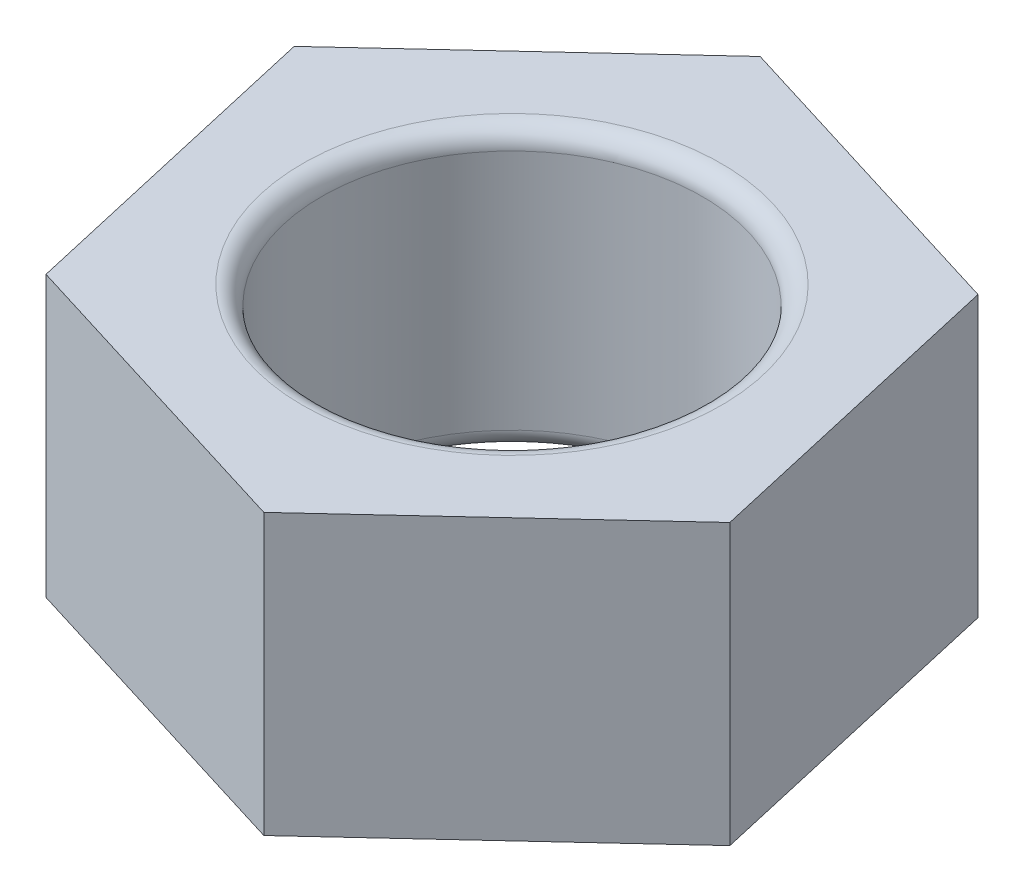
ISO-10303-21;
HEADER;
FILE_DESCRIPTION(('STEP AP214'),'2;1');
FILE_NAME('part.step','',(''),(''),'','','');
FILE_SCHEMA(('AUTOMOTIVE_DESIGN { 1 0 10303 214 1 1 1 1 }'));
ENDSEC;
DATA;
#1=APPLICATION_CONTEXT('core data for automotive mechanical design processes');
#2=APPLICATION_PROTOCOL_DEFINITION('international standard','automotive_design',2000,#1);
#3=PRODUCT_CONTEXT('',#1,'mechanical');
#4=PRODUCT('Part','Part','',(#3));
#5=PRODUCT_RELATED_PRODUCT_CATEGORY('part','',(#4));
#6=PRODUCT_DEFINITION_FORMATION('','',#4);
#7=PRODUCT_DEFINITION_CONTEXT('part definition',#1,'design');
#8=PRODUCT_DEFINITION('design','',#6,#7);
#9=PRODUCT_DEFINITION_SHAPE('','',#8);
#10=(LENGTH_UNIT() NAMED_UNIT(*) SI_UNIT(.MILLI.,.METRE.));
#11=(NAMED_UNIT(*) PLANE_ANGLE_UNIT() SI_UNIT($,.RADIAN.));
#12=(NAMED_UNIT(*) SI_UNIT($,.STERADIAN.) SOLID_ANGLE_UNIT());
#13=UNCERTAINTY_MEASURE_WITH_UNIT(LENGTH_MEASURE(1.E-05),#10,'distance_accuracy_value','');
#14=(GEOMETRIC_REPRESENTATION_CONTEXT(3) GLOBAL_UNCERTAINTY_ASSIGNED_CONTEXT((#13)) GLOBAL_UNIT_ASSIGNED_CONTEXT((#10,
#11,#12)) REPRESENTATION_CONTEXT('',''));
#15=CARTESIAN_POINT('',(0.,0.,0.));
#16=DIRECTION('',(0.,0.,1.));
#17=DIRECTION('',(1.,0.,0.));
#18=AXIS2_PLACEMENT_3D('',#15,#16,#17);
#19=CARTESIAN_POINT('',(0.,147.,0.));
#20=DIRECTION('',(0.,1.,0.));
#21=DIRECTION('',(0.,0.,1.));
#22=AXIS2_PLACEMENT_3D('',#19,#20,#21);
#23=PLANE('',#22);
#24=CARTESIAN_POINT('',(0.,147.,0.));
#25=DIRECTION('',(0.,1.,0.));
#26=DIRECTION('',(0.,0.,1.));
#27=AXIS2_PLACEMENT_3D('',#24,#25,#26);
#28=CIRCLE('',#27,110.);
#29=CARTESIAN_POINT('',(0.,147.,110.));
#30=VERTEX_POINT('',#29);
#31=EDGE_CURVE('E11',#30,#30,#28,.F.);
#32=ORIENTED_EDGE('',*,*,#31,.T.);
#33=EDGE_LOOP('',(#32));
#34=FACE_BOUND('',#33,.T.);
#35=DIRECTION('',(0.733165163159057,0.,-0.680050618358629));
#36=VECTOR('',#35,1.);
#37=CARTESIAN_POINT('',(38.5136271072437,147.,168.868885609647));
#38=LINE('',#37,#36);
#39=CARTESIAN_POINT('',(38.5136271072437,147.,168.868885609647));
#40=VERTEX_POINT('',#39);
#41=CARTESIAN_POINT('',(165.501558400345,147.,51.0806633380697));
#42=VERTEX_POINT('',#41);
#43=EDGE_CURVE('E127',#40,#42,#38,.T.);
#44=ORIENTED_EDGE('',*,*,#43,.T.);
#45=DIRECTION('',(-0.22235852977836,0.,-0.97496496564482));
#46=VECTOR('',#45,1.);
#47=CARTESIAN_POINT('',(165.501558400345,147.,51.0806633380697));
#48=LINE('',#47,#46);
#49=CARTESIAN_POINT('',(126.987931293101,147.,-117.788222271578));
#50=VERTEX_POINT('',#49);
#51=EDGE_CURVE('E87',#42,#50,#48,.T.);
#52=ORIENTED_EDGE('',*,*,#51,.T.);
#53=DIRECTION('',(-0.955523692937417,0.,-0.294914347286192));
#54=VECTOR('',#53,1.);
#55=CARTESIAN_POINT('',(126.987931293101,147.,-117.788222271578));
#56=LINE('',#55,#54);
#57=CARTESIAN_POINT('',(-38.5136271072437,147.,-168.868885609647));
#58=VERTEX_POINT('',#57);
#59=EDGE_CURVE('E99',#50,#58,#56,.T.);
#60=ORIENTED_EDGE('',*,*,#59,.T.);
#61=DIRECTION('',(-0.733165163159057,0.,0.680050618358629));
#62=VECTOR('',#61,1.);
#63=CARTESIAN_POINT('',(-38.5136271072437,147.,-168.868885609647));
#64=LINE('',#63,#62);
#65=CARTESIAN_POINT('',(-165.501558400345,147.,-51.0806633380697));
#66=VERTEX_POINT('',#65);
#67=EDGE_CURVE('E94',#58,#66,#64,.T.);
#68=ORIENTED_EDGE('',*,*,#67,.T.);
#69=DIRECTION('',(0.22235852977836,0.,0.974964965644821));
#70=VECTOR('',#69,1.);
#71=CARTESIAN_POINT('',(-165.501558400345,147.,-51.0806633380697));
#72=LINE('',#71,#70);
#73=CARTESIAN_POINT('',(-126.987931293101,147.,117.788222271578));
#74=VERTEX_POINT('',#73);
#75=EDGE_CURVE('E97',#66,#74,#72,.T.);
#76=ORIENTED_EDGE('',*,*,#75,.T.);
#77=DIRECTION('',(0.955523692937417,0.,0.294914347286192));
#78=VECTOR('',#77,1.);
#79=CARTESIAN_POINT('',(-126.987931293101,147.,117.788222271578));
#80=LINE('',#79,#78);
#81=EDGE_CURVE('E49',#74,#40,#80,.T.);
#82=ORIENTED_EDGE('',*,*,#81,.T.);
#83=EDGE_LOOP('',(#44,#52,#60,#68,#76,#82));
#84=FACE_BOUND('',#83,.T.);
#85=ADVANCED_FACE('F32',(#34,#84),#23,.T.);
#86=CARTESIAN_POINT('',(0.,0.,0.));
#87=DIRECTION('',(0.,1.,0.));
#88=DIRECTION('',(0.,0.,1.));
#89=AXIS2_PLACEMENT_3D('',#86,#87,#88);
#90=PLANE('',#89);
#91=CARTESIAN_POINT('',(0.,0.,0.));
#92=DIRECTION('',(0.,1.,0.));
#93=DIRECTION('',(0.,0.,1.));
#94=AXIS2_PLACEMENT_3D('',#91,#92,#93);
#95=CIRCLE('',#94,110.);
#96=CARTESIAN_POINT('',(0.,0.,110.));
#97=VERTEX_POINT('',#96);
#98=EDGE_CURVE('E136',#97,#97,#95,.T.);
#99=ORIENTED_EDGE('',*,*,#98,.T.);
#100=EDGE_LOOP('',(#99));
#101=FACE_BOUND('',#100,.T.);
#102=DIRECTION('',(0.733165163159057,0.,-0.680050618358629));
#103=VECTOR('',#102,1.);
#104=CARTESIAN_POINT('',(38.5136271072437,0.,168.868885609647));
#105=LINE('',#104,#103);
#106=CARTESIAN_POINT('',(38.5136271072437,0.,168.868885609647));
#107=VERTEX_POINT('',#106);
#108=CARTESIAN_POINT('',(165.501558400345,0.,51.0806633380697));
#109=VERTEX_POINT('',#108);
#110=EDGE_CURVE('E117',#107,#109,#105,.T.);
#111=ORIENTED_EDGE('',*,*,#110,.F.);
#112=DIRECTION('',(0.955523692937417,0.,0.294914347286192));
#113=VECTOR('',#112,1.);
#114=CARTESIAN_POINT('',(-126.987931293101,0.,117.788222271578));
#115=LINE('',#114,#113);
#116=CARTESIAN_POINT('',(-126.987931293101,0.,117.788222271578));
#117=VERTEX_POINT('',#116);
#118=EDGE_CURVE('E78',#117,#107,#115,.T.);
#119=ORIENTED_EDGE('',*,*,#118,.F.);
#120=DIRECTION('',(0.22235852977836,0.,0.974964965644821));
#121=VECTOR('',#120,1.);
#122=CARTESIAN_POINT('',(-165.501558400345,0.,-51.0806633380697));
#123=LINE('',#122,#121);
#124=CARTESIAN_POINT('',(-165.501558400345,0.,-51.0806633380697));
#125=VERTEX_POINT('',#124);
#126=EDGE_CURVE('E72',#125,#117,#123,.T.);
#127=ORIENTED_EDGE('',*,*,#126,.F.);
#128=DIRECTION('',(-0.733165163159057,0.,0.680050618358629));
#129=VECTOR('',#128,1.);
#130=CARTESIAN_POINT('',(-38.5136271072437,0.,-168.868885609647));
#131=LINE('',#130,#129);
#132=CARTESIAN_POINT('',(-38.5136271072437,0.,-168.868885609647));
#133=VERTEX_POINT('',#132);
#134=EDGE_CURVE('E107',#133,#125,#131,.T.);
#135=ORIENTED_EDGE('',*,*,#134,.F.);
#136=DIRECTION('',(-0.955523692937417,0.,-0.294914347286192));
#137=VECTOR('',#136,1.);
#138=CARTESIAN_POINT('',(126.987931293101,0.,-117.788222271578));
#139=LINE('',#138,#137);
#140=CARTESIAN_POINT('',(126.987931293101,0.,-117.788222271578));
#141=VERTEX_POINT('',#140);
#142=EDGE_CURVE('E122',#141,#133,#139,.T.);
#143=ORIENTED_EDGE('',*,*,#142,.F.);
#144=DIRECTION('',(-0.22235852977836,0.,-0.97496496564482));
#145=VECTOR('',#144,1.);
#146=CARTESIAN_POINT('',(165.501558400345,0.,51.0806633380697));
#147=LINE('',#146,#145);
#148=EDGE_CURVE('E120',#109,#141,#147,.T.);
#149=ORIENTED_EDGE('',*,*,#148,.F.);
#150=EDGE_LOOP('',(#111,#119,#127,#135,#143,#149));
#151=FACE_BOUND('',#150,.T.);
#152=ADVANCED_FACE('F152',(#101,#151),#90,.F.);
#153=CARTESIAN_POINT('',(38.5136271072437,147.,168.868885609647));
#154=DIRECTION('',(-0.680050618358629,0.,-0.733165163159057));
#155=DIRECTION('',(-0.733165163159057,0.,0.680050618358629));
#156=AXIS2_PLACEMENT_3D('',#153,#154,#155);
#157=PLANE('',#156);
#158=ORIENTED_EDGE('',*,*,#110,.T.);
#159=DIRECTION('',(0.,-1.,0.));
#160=VECTOR('',#159,1.);
#161=CARTESIAN_POINT('',(165.501558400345,147.,51.0806633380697));
#162=LINE('',#161,#160);
#163=EDGE_CURVE('E134',#42,#109,#162,.T.);
#164=ORIENTED_EDGE('',*,*,#163,.F.);
#165=ORIENTED_EDGE('',*,*,#43,.F.);
#166=DIRECTION('',(0.,-1.,0.));
#167=VECTOR('',#166,1.);
#168=CARTESIAN_POINT('',(38.5136271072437,147.,168.868885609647));
#169=LINE('',#168,#167);
#170=EDGE_CURVE('E113',#40,#107,#169,.T.);
#171=ORIENTED_EDGE('',*,*,#170,.T.);
#172=EDGE_LOOP('',(#158,#164,#165,#171));
#173=FACE_BOUND('',#172,.T.);
#174=ADVANCED_FACE('F155',(#173),#157,.F.);
#175=CARTESIAN_POINT('',(165.501558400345,147.,51.0806633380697));
#176=DIRECTION('',(-0.97496496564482,0.,0.22235852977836));
#177=DIRECTION('',(0.22235852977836,0.,0.974964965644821));
#178=AXIS2_PLACEMENT_3D('',#175,#176,#177);
#179=PLANE('',#178);
#180=ORIENTED_EDGE('',*,*,#148,.T.);
#181=DIRECTION('',(0.,-1.,0.));
#182=VECTOR('',#181,1.);
#183=CARTESIAN_POINT('',(126.987931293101,147.,-117.788222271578));
#184=LINE('',#183,#182);
#185=EDGE_CURVE('E131',#50,#141,#184,.T.);
#186=ORIENTED_EDGE('',*,*,#185,.F.);
#187=ORIENTED_EDGE('',*,*,#51,.F.);
#188=ORIENTED_EDGE('',*,*,#163,.T.);
#189=EDGE_LOOP('',(#180,#186,#187,#188));
#190=FACE_BOUND('',#189,.T.);
#191=ADVANCED_FACE('F231',(#190),#179,.F.);
#192=CARTESIAN_POINT('',(126.987931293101,147.,-117.788222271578));
#193=DIRECTION('',(-0.294914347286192,0.,0.955523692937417));
#194=DIRECTION('',(0.955523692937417,0.,0.294914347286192));
#195=AXIS2_PLACEMENT_3D('',#192,#193,#194);
#196=PLANE('',#195);
#197=ORIENTED_EDGE('',*,*,#142,.T.);
#198=DIRECTION('',(0.,-1.,0.));
#199=VECTOR('',#198,1.);
#200=CARTESIAN_POINT('',(-38.5136271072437,147.,-168.868885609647));
#201=LINE('',#200,#199);
#202=EDGE_CURVE('E108',#58,#133,#201,.T.);
#203=ORIENTED_EDGE('',*,*,#202,.F.);
#204=ORIENTED_EDGE('',*,*,#59,.F.);
#205=ORIENTED_EDGE('',*,*,#185,.T.);
#206=EDGE_LOOP('',(#197,#203,#204,#205));
#207=FACE_BOUND('',#206,.T.);
#208=ADVANCED_FACE('F222',(#207),#196,.F.);
#209=CARTESIAN_POINT('',(-38.5136271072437,147.,-168.868885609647));
#210=DIRECTION('',(0.680050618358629,0.,0.733165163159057));
#211=DIRECTION('',(0.733165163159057,0.,-0.680050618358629));
#212=AXIS2_PLACEMENT_3D('',#209,#210,#211);
#213=PLANE('',#212);
#214=ORIENTED_EDGE('',*,*,#134,.T.);
#215=DIRECTION('',(0.,-1.,0.));
#216=VECTOR('',#215,1.);
#217=CARTESIAN_POINT('',(-165.501558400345,147.,-51.0806633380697));
#218=LINE('',#217,#216);
#219=EDGE_CURVE('E104',#66,#125,#218,.T.);
#220=ORIENTED_EDGE('',*,*,#219,.F.);
#221=ORIENTED_EDGE('',*,*,#67,.F.);
#222=ORIENTED_EDGE('',*,*,#202,.T.);
#223=EDGE_LOOP('',(#214,#220,#221,#222));
#224=FACE_BOUND('',#223,.T.);
#225=ADVANCED_FACE('F105',(#224),#213,.F.);
#226=CARTESIAN_POINT('',(-165.501558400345,147.,-51.0806633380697));
#227=DIRECTION('',(0.97496496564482,0.,-0.22235852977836));
#228=DIRECTION('',(-0.22235852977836,0.,-0.974964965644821));
#229=AXIS2_PLACEMENT_3D('',#226,#227,#228);
#230=PLANE('',#229);
#231=ORIENTED_EDGE('',*,*,#126,.T.);
#232=DIRECTION('',(0.,-1.,0.));
#233=VECTOR('',#232,1.);
#234=CARTESIAN_POINT('',(-126.987931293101,147.,117.788222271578));
#235=LINE('',#234,#233);
#236=EDGE_CURVE('E109',#74,#117,#235,.T.);
#237=ORIENTED_EDGE('',*,*,#236,.F.);
#238=ORIENTED_EDGE('',*,*,#75,.F.);
#239=ORIENTED_EDGE('',*,*,#219,.T.);
#240=EDGE_LOOP('',(#231,#237,#238,#239));
#241=FACE_BOUND('',#240,.T.);
#242=ADVANCED_FACE('F111',(#241),#230,.F.);
#243=CARTESIAN_POINT('',(-126.987931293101,147.,117.788222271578));
#244=DIRECTION('',(0.294914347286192,0.,-0.955523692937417));
#245=DIRECTION('',(-0.955523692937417,0.,-0.294914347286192));
#246=AXIS2_PLACEMENT_3D('',#243,#244,#245);
#247=PLANE('',#246);
#248=ORIENTED_EDGE('',*,*,#118,.T.);
#249=ORIENTED_EDGE('',*,*,#170,.F.);
#250=ORIENTED_EDGE('',*,*,#81,.F.);
#251=ORIENTED_EDGE('',*,*,#236,.T.);
#252=EDGE_LOOP('',(#248,#249,#250,#251));
#253=FACE_BOUND('',#252,.T.);
#254=ADVANCED_FACE('F162',(#253),#247,.F.);
#255=CARTESIAN_POINT('',(0.,147.,0.));
#256=DIRECTION('',(0.,-1.,0.));
#257=DIRECTION('',(0.,0.,-1.));
#258=AXIS2_PLACEMENT_3D('',#255,#256,#257);
#259=CYLINDRICAL_SURFACE('',#258,100.);
#260=CARTESIAN_POINT('',(0.,10.,0.));
#261=DIRECTION('',(0.,1.,0.));
#262=DIRECTION('',(0.,0.,1.));
#263=AXIS2_PLACEMENT_3D('',#260,#261,#262);
#264=CIRCLE('',#263,100.);
#265=CARTESIAN_POINT('',(0.,10.,100.));
#266=VERTEX_POINT('',#265);
#267=EDGE_CURVE('E41',#266,#266,#264,.F.);
#268=ORIENTED_EDGE('',*,*,#267,.T.);
#269=EDGE_LOOP('',(#268));
#270=FACE_BOUND('',#269,.T.);
#271=CARTESIAN_POINT('',(0.,137.,0.));
#272=DIRECTION('',(0.,1.,0.));
#273=DIRECTION('',(0.,0.,1.));
#274=AXIS2_PLACEMENT_3D('',#271,#272,#273);
#275=CIRCLE('',#274,100.);
#276=CARTESIAN_POINT('',(0.,137.,100.));
#277=VERTEX_POINT('',#276);
#278=EDGE_CURVE('E139',#277,#277,#275,.T.);
#279=ORIENTED_EDGE('',*,*,#278,.T.);
#280=EDGE_LOOP('',(#279));
#281=FACE_BOUND('',#280,.T.);
#282=ADVANCED_FACE('F144',(#270,#281),#259,.F.);
#283=CARTESIAN_POINT('',(0.,10.,0.));
#284=DIRECTION('',(0.,1.,0.));
#285=DIRECTION('',(0.,0.,1.));
#286=AXIS2_PLACEMENT_3D('',#283,#284,#285);
#287=TOROIDAL_SURFACE('',#286,110.,10.);
#288=ORIENTED_EDGE('',*,*,#267,.F.);
#289=EDGE_LOOP('',(#288));
#290=FACE_BOUND('',#289,.T.);
#291=ORIENTED_EDGE('',*,*,#98,.F.);
#292=EDGE_LOOP('',(#291));
#293=FACE_BOUND('',#292,.T.);
#294=ADVANCED_FACE('F147',(#290,#293),#287,.T.);
#295=CARTESIAN_POINT('',(0.,137.,0.));
#296=DIRECTION('',(0.,1.,0.));
#297=DIRECTION('',(0.,0.,1.));
#298=AXIS2_PLACEMENT_3D('',#295,#296,#297);
#299=TOROIDAL_SURFACE('',#298,110.,10.);
#300=ORIENTED_EDGE('',*,*,#31,.F.);
#301=EDGE_LOOP('',(#300));
#302=FACE_BOUND('',#301,.T.);
#303=ORIENTED_EDGE('',*,*,#278,.F.);
#304=EDGE_LOOP('',(#303));
#305=FACE_BOUND('',#304,.T.);
#306=ADVANCED_FACE('F34',(#302,#305),#299,.T.);
#307=CLOSED_SHELL('',(#85,#152,#174,#191,#208,#225,#242,#254,#282,#294,#306));
#308=MANIFOLD_SOLID_BREP('B2',#307);
#309=ADVANCED_BREP_SHAPE_REPRESENTATION('',(#18,#308),#14);
#310=SHAPE_DEFINITION_REPRESENTATION(#9,#309);
ENDSEC;
END-ISO-10303-21;
